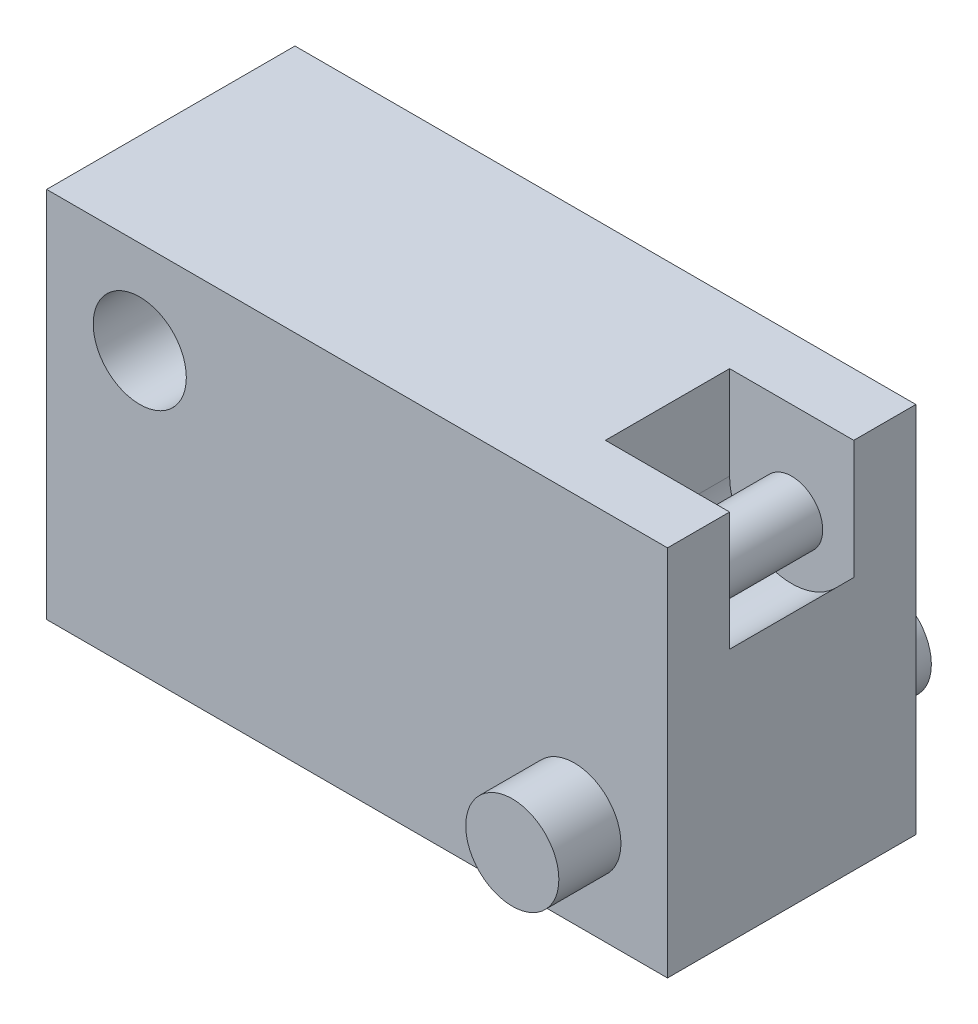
ISO-10303-21;
HEADER;
FILE_DESCRIPTION(('STEP AP214'),'2;1');
FILE_NAME('part.step','',(''),(''),'','','');
FILE_SCHEMA(('AUTOMOTIVE_DESIGN { 1 0 10303 214 1 1 1 1 }'));
ENDSEC;
DATA;
#1=APPLICATION_CONTEXT('core data for automotive mechanical design processes');
#2=APPLICATION_PROTOCOL_DEFINITION('international standard','automotive_design',2000,#1);
#3=PRODUCT_CONTEXT('',#1,'mechanical');
#4=PRODUCT('Part','Part','',(#3));
#5=PRODUCT_RELATED_PRODUCT_CATEGORY('part','',(#4));
#6=PRODUCT_DEFINITION_FORMATION('','',#4);
#7=PRODUCT_DEFINITION_CONTEXT('part definition',#1,'design');
#8=PRODUCT_DEFINITION('design','',#6,#7);
#9=PRODUCT_DEFINITION_SHAPE('','',#8);
#10=(LENGTH_UNIT() NAMED_UNIT(*) SI_UNIT(.MILLI.,.METRE.));
#11=(NAMED_UNIT(*) PLANE_ANGLE_UNIT() SI_UNIT($,.RADIAN.));
#12=(NAMED_UNIT(*) SI_UNIT($,.STERADIAN.) SOLID_ANGLE_UNIT());
#13=UNCERTAINTY_MEASURE_WITH_UNIT(LENGTH_MEASURE(1.E-05),#10,'distance_accuracy_value','');
#14=(GEOMETRIC_REPRESENTATION_CONTEXT(3) GLOBAL_UNCERTAINTY_ASSIGNED_CONTEXT((#13)) GLOBAL_UNIT_ASSIGNED_CONTEXT((#10,
#11,#12)) REPRESENTATION_CONTEXT('',''));
#15=CARTESIAN_POINT('',(0.,0.,0.));
#16=DIRECTION('',(0.,0.,1.));
#17=DIRECTION('',(1.,0.,0.));
#18=AXIS2_PLACEMENT_3D('',#15,#16,#17);
#19=CARTESIAN_POINT('',(5.,3.,2.));
#20=DIRECTION('',(-1.,0.,0.));
#21=DIRECTION('',(0.,0.,1.));
#22=AXIS2_PLACEMENT_3D('',#19,#20,#21);
#23=PLANE('',#22);
#24=DIRECTION('',(0.,1.,0.));
#25=VECTOR('',#24,1.);
#26=CARTESIAN_POINT('',(5.,3.,-1.));
#27=LINE('',#26,#25);
#28=CARTESIAN_POINT('',(5.,1.08578643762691,-1.));
#29=VERTEX_POINT('',#28);
#30=CARTESIAN_POINT('',(5.,3.,-1.));
#31=VERTEX_POINT('',#30);
#32=EDGE_CURVE('E144',#29,#31,#27,.T.);
#33=ORIENTED_EDGE('',*,*,#32,.F.);
#34=DIRECTION('',(0.,0.,1.));
#35=VECTOR('',#34,1.);
#36=CARTESIAN_POINT('',(5.,1.08578643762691,-1.));
#37=LINE('',#36,#35);
#38=CARTESIAN_POINT('',(5.,1.08578643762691,1.));
#39=VERTEX_POINT('',#38);
#40=EDGE_CURVE('E146',#29,#39,#37,.T.);
#41=ORIENTED_EDGE('',*,*,#40,.T.);
#42=DIRECTION('',(0.,1.,0.));
#43=VECTOR('',#42,1.);
#44=CARTESIAN_POINT('',(5.,3.,1.));
#45=LINE('',#44,#43);
#46=CARTESIAN_POINT('',(5.,3.,1.));
#47=VERTEX_POINT('',#46);
#48=EDGE_CURVE('E132',#39,#47,#45,.T.);
#49=ORIENTED_EDGE('',*,*,#48,.T.);
#50=DIRECTION('',(0.,0.,-1.));
#51=VECTOR('',#50,1.);
#52=CARTESIAN_POINT('',(5.,3.,2.));
#53=LINE('',#52,#51);
#54=CARTESIAN_POINT('',(5.,3.,2.));
#55=VERTEX_POINT('',#54);
#56=EDGE_CURVE('E184',#55,#47,#53,.T.);
#57=ORIENTED_EDGE('',*,*,#56,.F.);
#58=DIRECTION('',(0.,1.,0.));
#59=VECTOR('',#58,1.);
#60=CARTESIAN_POINT('',(5.,3.,2.));
#61=LINE('',#60,#59);
#62=CARTESIAN_POINT('',(5.,-3.,2.));
#63=VERTEX_POINT('',#62);
#64=EDGE_CURVE('E177',#63,#55,#61,.T.);
#65=ORIENTED_EDGE('',*,*,#64,.F.);
#66=DIRECTION('',(0.,0.,-1.));
#67=VECTOR('',#66,1.);
#68=CARTESIAN_POINT('',(5.,-3.,2.));
#69=LINE('',#68,#67);
#70=CARTESIAN_POINT('',(5.,-3.,-2.));
#71=VERTEX_POINT('',#70);
#72=EDGE_CURVE('E187',#63,#71,#69,.T.);
#73=ORIENTED_EDGE('',*,*,#72,.T.);
#74=DIRECTION('',(0.,1.,0.));
#75=VECTOR('',#74,1.);
#76=CARTESIAN_POINT('',(5.,3.,-2.));
#77=LINE('',#76,#75);
#78=CARTESIAN_POINT('',(5.,3.,-2.));
#79=VERTEX_POINT('',#78);
#80=EDGE_CURVE('E168',#71,#79,#77,.T.);
#81=ORIENTED_EDGE('',*,*,#80,.T.);
#82=EDGE_CURVE('E183',#31,#79,#53,.T.);
#83=ORIENTED_EDGE('',*,*,#82,.F.);
#84=EDGE_LOOP('',(#33,#41,#49,#57,#65,#73,#81,#83));
#85=FACE_BOUND('',#84,.T.);
#86=ADVANCED_FACE('F33',(#85),#23,.F.);
#87=CARTESIAN_POINT('',(-5.,2.99999999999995,2.));
#88=DIRECTION('',(0.,-1.,0.));
#89=DIRECTION('',(1.,0.,0.));
#90=AXIS2_PLACEMENT_3D('',#87,#88,#89);
#91=PLANE('',#90);
#92=DIRECTION('',(-1.,0.,0.));
#93=VECTOR('',#92,1.);
#94=CARTESIAN_POINT('',(3.,3.,-1.));
#95=LINE('',#94,#93);
#96=CARTESIAN_POINT('',(3.,3.,-1.));
#97=VERTEX_POINT('',#96);
#98=EDGE_CURVE('E135',#31,#97,#95,.T.);
#99=ORIENTED_EDGE('',*,*,#98,.F.);
#100=ORIENTED_EDGE('',*,*,#82,.T.);
#101=DIRECTION('',(-1.,0.,0.));
#102=VECTOR('',#101,1.);
#103=CARTESIAN_POINT('',(-5.,2.99999999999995,-2.));
#104=LINE('',#103,#102);
#105=CARTESIAN_POINT('',(-5.,2.99999999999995,-2.));
#106=VERTEX_POINT('',#105);
#107=EDGE_CURVE('E171',#79,#106,#104,.T.);
#108=ORIENTED_EDGE('',*,*,#107,.T.);
#109=DIRECTION('',(0.,0.,-1.));
#110=VECTOR('',#109,1.);
#111=CARTESIAN_POINT('',(-5.,2.99999999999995,2.));
#112=LINE('',#111,#110);
#113=CARTESIAN_POINT('',(-5.,2.99999999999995,2.));
#114=VERTEX_POINT('',#113);
#115=EDGE_CURVE('E180',#114,#106,#112,.T.);
#116=ORIENTED_EDGE('',*,*,#115,.F.);
#117=DIRECTION('',(-1.,0.,0.));
#118=VECTOR('',#117,1.);
#119=CARTESIAN_POINT('',(-5.,2.99999999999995,2.));
#120=LINE('',#119,#118);
#121=EDGE_CURVE('E57',#55,#114,#120,.T.);
#122=ORIENTED_EDGE('',*,*,#121,.F.);
#123=ORIENTED_EDGE('',*,*,#56,.T.);
#124=DIRECTION('',(-1.,0.,0.));
#125=VECTOR('',#124,1.);
#126=CARTESIAN_POINT('',(3.,3.,1.));
#127=LINE('',#126,#125);
#128=CARTESIAN_POINT('',(3.,3.,1.));
#129=VERTEX_POINT('',#128);
#130=EDGE_CURVE('E125',#47,#129,#127,.T.);
#131=ORIENTED_EDGE('',*,*,#130,.T.);
#132=DIRECTION('',(0.,0.,1.));
#133=VECTOR('',#132,1.);
#134=CARTESIAN_POINT('',(3.,3.,-1.));
#135=LINE('',#134,#133);
#136=EDGE_CURVE('E115',#97,#129,#135,.T.);
#137=ORIENTED_EDGE('',*,*,#136,.F.);
#138=EDGE_LOOP('',(#99,#100,#108,#116,#122,#123,#131,#137));
#139=FACE_BOUND('',#138,.T.);
#140=ADVANCED_FACE('F211',(#139),#91,.F.);
#141=CARTESIAN_POINT('',(-5.,-3.00000000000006,2.));
#142=DIRECTION('',(0.,0.,1.));
#143=DIRECTION('',(1.,0.,0.));
#144=AXIS2_PLACEMENT_3D('',#141,#142,#143);
#145=PLANE('',#144);
#146=CARTESIAN_POINT('',(-3.5,1.49999999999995,2.));
#147=DIRECTION('',(0.,0.,1.));
#148=DIRECTION('',(1.,0.,0.));
#149=AXIS2_PLACEMENT_3D('',#146,#147,#148);
#150=CIRCLE('',#149,0.75);
#151=CARTESIAN_POINT('',(-2.75,1.49999999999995,2.));
#152=VERTEX_POINT('',#151);
#153=EDGE_CURVE('E151',#152,#152,#150,.T.);
#154=ORIENTED_EDGE('',*,*,#153,.F.);
#155=EDGE_LOOP('',(#154));
#156=FACE_BOUND('',#155,.T.);
#157=DIRECTION('',(0.,-1.,0.));
#158=VECTOR('',#157,1.);
#159=CARTESIAN_POINT('',(-5.,2.99999999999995,2.));
#160=LINE('',#159,#158);
#161=CARTESIAN_POINT('',(-5.,-3.00000000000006,2.));
#162=VERTEX_POINT('',#161);
#163=EDGE_CURVE('E173',#114,#162,#160,.T.);
#164=ORIENTED_EDGE('',*,*,#163,.T.);
#165=DIRECTION('',(1.,0.,0.));
#166=VECTOR('',#165,1.);
#167=CARTESIAN_POINT('',(-5.,-3.00000000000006,2.));
#168=LINE('',#167,#166);
#169=EDGE_CURVE('E175',#162,#63,#168,.T.);
#170=ORIENTED_EDGE('',*,*,#169,.T.);
#171=ORIENTED_EDGE('',*,*,#64,.T.);
#172=ORIENTED_EDGE('',*,*,#121,.T.);
#173=EDGE_LOOP('',(#164,#170,#171,#172));
#174=FACE_BOUND('',#173,.T.);
#175=CARTESIAN_POINT('',(3.50000000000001,-1.5,2.));
#176=DIRECTION('',(0.,0.,1.));
#177=DIRECTION('',(1.,0.,0.));
#178=AXIS2_PLACEMENT_3D('',#175,#176,#177);
#179=CIRCLE('',#178,0.75);
#180=CARTESIAN_POINT('',(4.25000000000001,-1.5,2.));
#181=VERTEX_POINT('',#180);
#182=EDGE_CURVE('E160',#181,#181,#179,.F.);
#183=ORIENTED_EDGE('',*,*,#182,.T.);
#184=EDGE_LOOP('',(#183));
#185=FACE_BOUND('',#184,.T.);
#186=ADVANCED_FACE('F208',(#156,#174,#185),#145,.T.);
#187=CARTESIAN_POINT('',(-5.,-3.00000000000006,-2.));
#188=DIRECTION('',(0.,0.,1.));
#189=DIRECTION('',(1.,0.,0.));
#190=AXIS2_PLACEMENT_3D('',#187,#188,#189);
#191=PLANE('',#190);
#192=CARTESIAN_POINT('',(-3.5,1.49999999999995,-2.));
#193=DIRECTION('',(0.,0.,1.));
#194=DIRECTION('',(1.,0.,0.));
#195=AXIS2_PLACEMENT_3D('',#192,#193,#194);
#196=CIRCLE('',#195,0.75);
#197=CARTESIAN_POINT('',(-2.75,1.49999999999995,-2.));
#198=VERTEX_POINT('',#197);
#199=EDGE_CURVE('E37',#198,#198,#196,.T.);
#200=ORIENTED_EDGE('',*,*,#199,.T.);
#201=EDGE_LOOP('',(#200));
#202=FACE_BOUND('',#201,.T.);
#203=DIRECTION('',(0.,-1.,0.));
#204=VECTOR('',#203,1.);
#205=CARTESIAN_POINT('',(-5.,2.99999999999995,-2.));
#206=LINE('',#205,#204);
#207=CARTESIAN_POINT('',(-5.,-3.00000000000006,-2.));
#208=VERTEX_POINT('',#207);
#209=EDGE_CURVE('E163',#106,#208,#206,.T.);
#210=ORIENTED_EDGE('',*,*,#209,.F.);
#211=ORIENTED_EDGE('',*,*,#107,.F.);
#212=ORIENTED_EDGE('',*,*,#80,.F.);
#213=DIRECTION('',(1.,0.,0.));
#214=VECTOR('',#213,1.);
#215=CARTESIAN_POINT('',(-5.,-3.00000000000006,-2.));
#216=LINE('',#215,#214);
#217=EDGE_CURVE('E166',#208,#71,#216,.T.);
#218=ORIENTED_EDGE('',*,*,#217,.F.);
#219=EDGE_LOOP('',(#210,#211,#212,#218));
#220=FACE_BOUND('',#219,.T.);
#221=CARTESIAN_POINT('',(3.50000000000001,-1.5,-2.));
#222=DIRECTION('',(0.,0.,1.));
#223=DIRECTION('',(1.,0.,0.));
#224=AXIS2_PLACEMENT_3D('',#221,#222,#223);
#225=CIRCLE('',#224,0.75);
#226=CARTESIAN_POINT('',(4.25000000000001,-1.5,-2.));
#227=VERTEX_POINT('',#226);
#228=EDGE_CURVE('E11',#227,#227,#225,.F.);
#229=ORIENTED_EDGE('',*,*,#228,.F.);
#230=EDGE_LOOP('',(#229));
#231=FACE_BOUND('',#230,.T.);
#232=ADVANCED_FACE('F200',(#202,#220,#231),#191,.F.);
#233=CARTESIAN_POINT('',(-5.,2.99999999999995,2.));
#234=DIRECTION('',(1.,0.,0.));
#235=DIRECTION('',(0.,0.,-1.));
#236=AXIS2_PLACEMENT_3D('',#233,#234,#235);
#237=PLANE('',#236);
#238=ORIENTED_EDGE('',*,*,#209,.T.);
#239=DIRECTION('',(0.,0.,-1.));
#240=VECTOR('',#239,1.);
#241=CARTESIAN_POINT('',(-5.,-3.00000000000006,2.));
#242=LINE('',#241,#240);
#243=EDGE_CURVE('E42',#162,#208,#242,.T.);
#244=ORIENTED_EDGE('',*,*,#243,.F.);
#245=ORIENTED_EDGE('',*,*,#163,.F.);
#246=ORIENTED_EDGE('',*,*,#115,.T.);
#247=EDGE_LOOP('',(#238,#244,#245,#246));
#248=FACE_BOUND('',#247,.T.);
#249=ADVANCED_FACE('F35',(#248),#237,.F.);
#250=CARTESIAN_POINT('',(-5.,-3.00000000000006,2.));
#251=DIRECTION('',(0.,1.,0.));
#252=DIRECTION('',(-1.,0.,0.));
#253=AXIS2_PLACEMENT_3D('',#250,#251,#252);
#254=PLANE('',#253);
#255=ORIENTED_EDGE('',*,*,#217,.T.);
#256=ORIENTED_EDGE('',*,*,#72,.F.);
#257=ORIENTED_EDGE('',*,*,#169,.F.);
#258=ORIENTED_EDGE('',*,*,#243,.T.);
#259=EDGE_LOOP('',(#255,#256,#257,#258));
#260=FACE_BOUND('',#259,.T.);
#261=ADVANCED_FACE('F193',(#260),#254,.F.);
#262=CARTESIAN_POINT('',(3.50000000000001,-1.5,-3.));
#263=DIRECTION('',(0.,0.,1.));
#264=DIRECTION('',(1.,0.,0.));
#265=AXIS2_PLACEMENT_3D('',#262,#263,#264);
#266=PLANE('',#265);
#267=CARTESIAN_POINT('',(3.50000000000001,-1.5,-3.));
#268=DIRECTION('',(0.,0.,1.));
#269=DIRECTION('',(1.,0.,0.));
#270=AXIS2_PLACEMENT_3D('',#267,#268,#269);
#271=CIRCLE('',#270,0.75);
#272=CARTESIAN_POINT('',(4.25000000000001,-1.5,-3.));
#273=VERTEX_POINT('',#272);
#274=EDGE_CURVE('E154',#273,#273,#271,.T.);
#275=ORIENTED_EDGE('',*,*,#274,.F.);
#276=EDGE_LOOP('',(#275));
#277=FACE_BOUND('',#276,.T.);
#278=ADVANCED_FACE('F242',(#277),#266,.F.);
#279=CARTESIAN_POINT('',(3.50000000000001,-1.5,3.));
#280=DIRECTION('',(0.,0.,-1.));
#281=DIRECTION('',(-1.,0.,0.));
#282=AXIS2_PLACEMENT_3D('',#279,#280,#281);
#283=CYLINDRICAL_SURFACE('',#282,0.75);
#284=ORIENTED_EDGE('',*,*,#274,.T.);
#285=EDGE_LOOP('',(#284));
#286=FACE_BOUND('',#285,.T.);
#287=ORIENTED_EDGE('',*,*,#228,.T.);
#288=EDGE_LOOP('',(#287));
#289=FACE_BOUND('',#288,.T.);
#290=ADVANCED_FACE('F220',(#286,#289),#283,.T.);
#291=ORIENTED_EDGE('',*,*,#182,.F.);
#292=EDGE_LOOP('',(#291));
#293=FACE_BOUND('',#292,.T.);
#294=CARTESIAN_POINT('',(3.50000000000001,-1.5,3.));
#295=DIRECTION('',(0.,0.,1.));
#296=DIRECTION('',(1.,0.,0.));
#297=AXIS2_PLACEMENT_3D('',#294,#295,#296);
#298=CIRCLE('',#297,0.75);
#299=CARTESIAN_POINT('',(4.25000000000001,-1.5,3.));
#300=VERTEX_POINT('',#299);
#301=EDGE_CURVE('E157',#300,#300,#298,.T.);
#302=ORIENTED_EDGE('',*,*,#301,.F.);
#303=EDGE_LOOP('',(#302));
#304=FACE_BOUND('',#303,.T.);
#305=ADVANCED_FACE('F216',(#293,#304),#283,.T.);
#306=CARTESIAN_POINT('',(3.50000000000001,-1.5,3.));
#307=DIRECTION('',(0.,0.,1.));
#308=DIRECTION('',(1.,0.,0.));
#309=AXIS2_PLACEMENT_3D('',#306,#307,#308);
#310=PLANE('',#309);
#311=ORIENTED_EDGE('',*,*,#301,.T.);
#312=EDGE_LOOP('',(#311));
#313=FACE_BOUND('',#312,.T.);
#314=ADVANCED_FACE('F219',(#313),#310,.T.);
#315=CARTESIAN_POINT('',(-3.5,1.49999999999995,-3.));
#316=DIRECTION('',(0.,0.,1.));
#317=DIRECTION('',(1.,0.,0.));
#318=AXIS2_PLACEMENT_3D('',#315,#316,#317);
#319=CYLINDRICAL_SURFACE('',#318,0.75);
#320=ORIENTED_EDGE('',*,*,#153,.T.);
#321=EDGE_LOOP('',(#320));
#322=FACE_BOUND('',#321,.T.);
#323=ORIENTED_EDGE('',*,*,#199,.F.);
#324=EDGE_LOOP('',(#323));
#325=FACE_BOUND('',#324,.T.);
#326=ADVANCED_FACE('F225',(#322,#325),#319,.F.);
#327=CARTESIAN_POINT('',(4.70710678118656,0.792893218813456,-1.));
#328=DIRECTION('',(0.707106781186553,-0.707106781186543,0.));
#329=DIRECTION('',(0.707106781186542,0.707106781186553,0.));
#330=AXIS2_PLACEMENT_3D('',#327,#328,#329);
#331=PLANE('',#330);
#332=DIRECTION('',(0.707106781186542,0.707106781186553,0.));
#333=VECTOR('',#332,1.);
#334=CARTESIAN_POINT('',(4.70710678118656,0.792893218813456,1.));
#335=LINE('',#334,#333);
#336=CARTESIAN_POINT('',(4.70710678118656,0.792893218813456,1.));
#337=VERTEX_POINT('',#336);
#338=EDGE_CURVE('E120',#337,#39,#335,.T.);
#339=ORIENTED_EDGE('',*,*,#338,.T.);
#340=ORIENTED_EDGE('',*,*,#40,.F.);
#341=DIRECTION('',(0.707106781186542,0.707106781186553,0.));
#342=VECTOR('',#341,1.);
#343=CARTESIAN_POINT('',(4.70710678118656,0.792893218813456,-1.));
#344=LINE('',#343,#342);
#345=CARTESIAN_POINT('',(4.70710678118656,0.792893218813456,-1.));
#346=VERTEX_POINT('',#345);
#347=EDGE_CURVE('E141',#346,#29,#344,.T.);
#348=ORIENTED_EDGE('',*,*,#347,.F.);
#349=DIRECTION('',(0.,0.,1.));
#350=VECTOR('',#349,1.);
#351=CARTESIAN_POINT('',(4.70710678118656,0.792893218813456,-1.));
#352=LINE('',#351,#350);
#353=EDGE_CURVE('E114',#346,#337,#352,.T.);
#354=ORIENTED_EDGE('',*,*,#353,.T.);
#355=EDGE_LOOP('',(#339,#340,#348,#354));
#356=FACE_BOUND('',#355,.T.);
#357=ADVANCED_FACE('F230',(#356),#331,.F.);
#358=CARTESIAN_POINT('',(4.,1.5,-1.));
#359=DIRECTION('',(0.,0.,1.));
#360=DIRECTION('',(1.,0.,0.));
#361=AXIS2_PLACEMENT_3D('',#358,#359,#360);
#362=CYLINDRICAL_SURFACE('',#361,1.);
#363=CARTESIAN_POINT('',(4.,1.5,1.));
#364=DIRECTION('',(0.,0.,1.));
#365=DIRECTION('',(1.,0.,0.));
#366=AXIS2_PLACEMENT_3D('',#363,#364,#365);
#367=CIRCLE('',#366,1.);
#368=CARTESIAN_POINT('',(3.,1.5,1.));
#369=VERTEX_POINT('',#368);
#370=EDGE_CURVE('E109',#369,#337,#367,.T.);
#371=ORIENTED_EDGE('',*,*,#370,.T.);
#372=ORIENTED_EDGE('',*,*,#353,.F.);
#373=CARTESIAN_POINT('',(4.,1.5,-1.));
#374=DIRECTION('',(0.,0.,1.));
#375=DIRECTION('',(1.,0.,0.));
#376=AXIS2_PLACEMENT_3D('',#373,#374,#375);
#377=CIRCLE('',#376,1.);
#378=CARTESIAN_POINT('',(3.,1.5,-1.));
#379=VERTEX_POINT('',#378);
#380=EDGE_CURVE('E111',#379,#346,#377,.T.);
#381=ORIENTED_EDGE('',*,*,#380,.F.);
#382=DIRECTION('',(0.,0.,1.));
#383=VECTOR('',#382,1.);
#384=CARTESIAN_POINT('',(3.,1.5,-1.));
#385=LINE('',#384,#383);
#386=EDGE_CURVE('E107',#379,#369,#385,.T.);
#387=ORIENTED_EDGE('',*,*,#386,.T.);
#388=EDGE_LOOP('',(#371,#372,#381,#387));
#389=FACE_BOUND('',#388,.T.);
#390=ADVANCED_FACE('F108',(#389),#362,.F.);
#391=CARTESIAN_POINT('',(3.,3.,-1.));
#392=DIRECTION('',(-1.,0.,0.));
#393=DIRECTION('',(0.,-1.,0.));
#394=AXIS2_PLACEMENT_3D('',#391,#392,#393);
#395=PLANE('',#394);
#396=DIRECTION('',(0.,-1.,0.));
#397=VECTOR('',#396,1.);
#398=CARTESIAN_POINT('',(3.,3.,1.));
#399=LINE('',#398,#397);
#400=EDGE_CURVE('E49',#129,#369,#399,.T.);
#401=ORIENTED_EDGE('',*,*,#400,.T.);
#402=ORIENTED_EDGE('',*,*,#386,.F.);
#403=DIRECTION('',(0.,-1.,0.));
#404=VECTOR('',#403,1.);
#405=CARTESIAN_POINT('',(3.,3.,-1.));
#406=LINE('',#405,#404);
#407=EDGE_CURVE('E138',#97,#379,#406,.T.);
#408=ORIENTED_EDGE('',*,*,#407,.F.);
#409=ORIENTED_EDGE('',*,*,#136,.T.);
#410=EDGE_LOOP('',(#401,#402,#408,#409));
#411=FACE_BOUND('',#410,.T.);
#412=ADVANCED_FACE('F122',(#411),#395,.F.);
#413=CARTESIAN_POINT('',(4.,1.5,-1.));
#414=DIRECTION('',(0.,0.,1.));
#415=DIRECTION('',(1.,0.,0.));
#416=AXIS2_PLACEMENT_3D('',#413,#414,#415);
#417=PLANE('',#416);
#418=CARTESIAN_POINT('',(4.,1.5,-1.));
#419=DIRECTION('',(0.,0.,1.));
#420=DIRECTION('',(1.,0.,0.));
#421=AXIS2_PLACEMENT_3D('',#418,#419,#420);
#422=CIRCLE('',#421,0.5);
#423=CARTESIAN_POINT('',(4.5,1.5,-1.));
#424=VERTEX_POINT('',#423);
#425=EDGE_CURVE('E127',#424,#424,#422,.T.);
#426=ORIENTED_EDGE('',*,*,#425,.F.);
#427=EDGE_LOOP('',(#426));
#428=FACE_BOUND('',#427,.T.);
#429=ORIENTED_EDGE('',*,*,#98,.T.);
#430=ORIENTED_EDGE('',*,*,#407,.T.);
#431=ORIENTED_EDGE('',*,*,#380,.T.);
#432=ORIENTED_EDGE('',*,*,#347,.T.);
#433=ORIENTED_EDGE('',*,*,#32,.T.);
#434=EDGE_LOOP('',(#429,#430,#431,#432,#433));
#435=FACE_BOUND('',#434,.T.);
#436=ADVANCED_FACE('F297',(#428,#435),#417,.T.);
#437=CARTESIAN_POINT('',(4.,1.5,1.));
#438=DIRECTION('',(0.,0.,1.));
#439=DIRECTION('',(1.,0.,0.));
#440=AXIS2_PLACEMENT_3D('',#437,#438,#439);
#441=PLANE('',#440);
#442=CARTESIAN_POINT('',(4.,1.5,1.));
#443=DIRECTION('',(0.,0.,1.));
#444=DIRECTION('',(1.,0.,0.));
#445=AXIS2_PLACEMENT_3D('',#442,#443,#444);
#446=CIRCLE('',#445,0.5);
#447=CARTESIAN_POINT('',(4.5,1.5,1.));
#448=VERTEX_POINT('',#447);
#449=EDGE_CURVE('E378',#448,#448,#446,.T.);
#450=ORIENTED_EDGE('',*,*,#449,.T.);
#451=EDGE_LOOP('',(#450));
#452=FACE_BOUND('',#451,.T.);
#453=ORIENTED_EDGE('',*,*,#130,.F.);
#454=ORIENTED_EDGE('',*,*,#48,.F.);
#455=ORIENTED_EDGE('',*,*,#338,.F.);
#456=ORIENTED_EDGE('',*,*,#370,.F.);
#457=ORIENTED_EDGE('',*,*,#400,.F.);
#458=EDGE_LOOP('',(#453,#454,#455,#456,#457));
#459=FACE_BOUND('',#458,.T.);
#460=ADVANCED_FACE('F118',(#452,#459),#441,.F.);
#461=CARTESIAN_POINT('',(4.,1.5,-1.));
#462=DIRECTION('',(0.,0.,1.));
#463=DIRECTION('',(1.,0.,0.));
#464=AXIS2_PLACEMENT_3D('',#461,#462,#463);
#465=CYLINDRICAL_SURFACE('',#464,0.5);
#466=ORIENTED_EDGE('',*,*,#425,.T.);
#467=EDGE_LOOP('',(#466));
#468=FACE_BOUND('',#467,.T.);
#469=ORIENTED_EDGE('',*,*,#449,.F.);
#470=EDGE_LOOP('',(#469));
#471=FACE_BOUND('',#470,.T.);
#472=ADVANCED_FACE('F313',(#468,#471),#465,.T.);
#473=CLOSED_SHELL('',(#86,#140,#186,#232,#249,#261,#278,#290,#305,#314,#326,#357,#390,#412,#436,
#460,#472));
#474=MANIFOLD_SOLID_BREP('B2',#473);
#475=ADVANCED_BREP_SHAPE_REPRESENTATION('',(#18,#474),#14);
#476=SHAPE_DEFINITION_REPRESENTATION(#9,#475);
ENDSEC;
END-ISO-10303-21;
